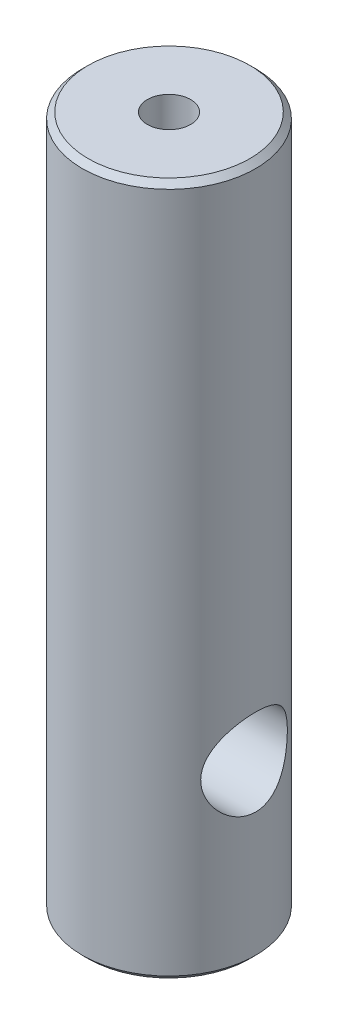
from build123d import *

# Parameters (mm, degrees)
SKETCH1_R           = 9.525
BOSS_EXTRUDE1_DEPTH = 76.2
SKETCH2_R           = 2.38125
CUT_EXTRUDE1_DEPTH  = 38.1
SKETCH3_R           = 4.7625
CUT_EXTRUDE2_DEPTH  = 19.05
CHAMFER1_SIZE       = 0.635


with BuildPart() as part:
    # Sketch1 → Boss-Extrude1 (new body)
    with BuildSketch(Plane(origin=(0, 0, 0), x_dir=(1, 0, 0), z_dir=(0, 1, 0))):
        with Locations(Location((0, 0, 0), (0, 0, 90))):
            Circle(SKETCH1_R)
    extrude(amount=BOSS_EXTRUDE1_DEPTH)

    # Sketch2 → Cut-Extrude1 (cut)
    with BuildSketch(Plane(origin=(0, 76.2, 0), x_dir=(1, 0, 0), z_dir=(0, 1, 0))):
        with Locations(Location((0, 0, 0), (0, 0, 270))):
            Circle(SKETCH2_R)
    extrude(amount=-CUT_EXTRUDE1_DEPTH, mode=Mode.SUBTRACT)

    # Sketch3 → Cut-Extrude2 (cut, symmetric)
    with BuildSketch(Plane(origin=(0, 0, 0), x_dir=(0, 0, -1), z_dir=(1, 0, 0))):
        with Locations((0, 19.05)):
            Circle(SKETCH3_R)
    extrude(amount=CUT_EXTRUDE2_DEPTH, both=True, mode=Mode.SUBTRACT)

    # Chamfer1
    chamfer1_edges = [part.edges().sort_by_distance(p)[0] for p in [
        (0, 0, 9.525),
        (0, 76.2, 9.525),
    ]]
    chamfer(chamfer1_edges, length=CHAMFER1_SIZE)


solid = part.part
